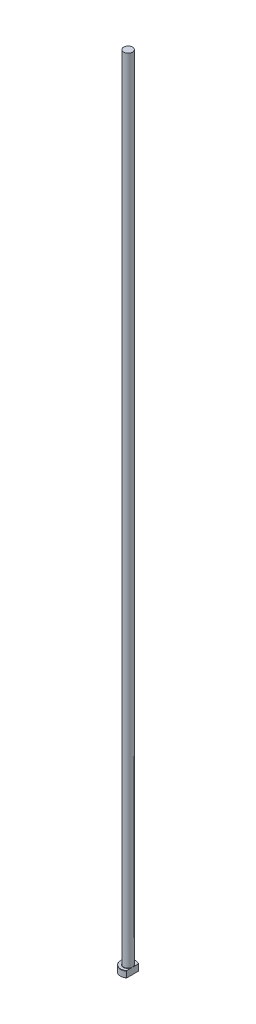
ISO-10303-21;
HEADER;
FILE_DESCRIPTION(('STEP AP214'),'2;1');
FILE_NAME('part.step','',(''),(''),'','','');
FILE_SCHEMA(('AUTOMOTIVE_DESIGN { 1 0 10303 214 1 1 1 1 }'));
ENDSEC;
DATA;
#1=APPLICATION_CONTEXT('core data for automotive mechanical design processes');
#2=APPLICATION_PROTOCOL_DEFINITION('international standard','automotive_design',2000,#1);
#3=PRODUCT_CONTEXT('',#1,'mechanical');
#4=PRODUCT('Part','Part','',(#3));
#5=PRODUCT_RELATED_PRODUCT_CATEGORY('part','',(#4));
#6=PRODUCT_DEFINITION_FORMATION('','',#4);
#7=PRODUCT_DEFINITION_CONTEXT('part definition',#1,'design');
#8=PRODUCT_DEFINITION('design','',#6,#7);
#9=PRODUCT_DEFINITION_SHAPE('','',#8);
#10=(LENGTH_UNIT() NAMED_UNIT(*) SI_UNIT(.MILLI.,.METRE.));
#11=(NAMED_UNIT(*) PLANE_ANGLE_UNIT() SI_UNIT($,.RADIAN.));
#12=(NAMED_UNIT(*) SI_UNIT($,.STERADIAN.) SOLID_ANGLE_UNIT());
#13=UNCERTAINTY_MEASURE_WITH_UNIT(LENGTH_MEASURE(1.E-05),#10,'distance_accuracy_value','');
#14=(GEOMETRIC_REPRESENTATION_CONTEXT(3) GLOBAL_UNCERTAINTY_ASSIGNED_CONTEXT((#13)) GLOBAL_UNIT_ASSIGNED_CONTEXT((#10,
#11,#12)) REPRESENTATION_CONTEXT('',''));
#15=CARTESIAN_POINT('',(0.,0.,0.));
#16=DIRECTION('',(0.,0.,1.));
#17=DIRECTION('',(1.,0.,0.));
#18=AXIS2_PLACEMENT_3D('',#15,#16,#17);
#19=CARTESIAN_POINT('',(0.,0.,0.));
#20=DIRECTION('',(0.,-1.,0.));
#21=DIRECTION('',(0.,0.,-1.));
#22=AXIS2_PLACEMENT_3D('',#19,#20,#21);
#23=PLANE('',#22);
#24=CARTESIAN_POINT('',(0.,0.,0.));
#25=DIRECTION('',(0.,-1.,0.));
#26=DIRECTION('',(0.,0.,-1.));
#27=AXIS2_PLACEMENT_3D('',#24,#25,#26);
#28=CIRCLE('',#27,5.79999999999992);
#29=CARTESIAN_POINT('',(3.49999999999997,0.,4.62493243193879));
#30=VERTEX_POINT('',#29);
#31=CARTESIAN_POINT('',(3.49999999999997,0.,-4.62493243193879));
#32=VERTEX_POINT('',#31);
#33=EDGE_CURVE('E98',#30,#32,#28,.T.);
#34=ORIENTED_EDGE('',*,*,#33,.T.);
#35=DIRECTION('',(0.,0.,1.));
#36=VECTOR('',#35,1.);
#37=CARTESIAN_POINT('',(3.49999999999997,0.,-4.87339717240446));
#38=LINE('',#37,#36);
#39=EDGE_CURVE('E83',#32,#30,#38,.T.);
#40=ORIENTED_EDGE('',*,*,#39,.T.);
#41=EDGE_LOOP('',(#34,#40));
#42=FACE_BOUND('',#41,.T.);
#43=ADVANCED_FACE('F32',(#42),#23,.T.);
#44=CARTESIAN_POINT('',(0.,259.958771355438,0.));
#45=DIRECTION('',(0.,1.,0.));
#46=DIRECTION('',(0.,0.,1.));
#47=AXIS2_PLACEMENT_3D('',#44,#45,#46);
#48=CYLINDRICAL_SURFACE('',#47,5.99999999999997);
#49=CARTESIAN_POINT('',(0.,4.80000000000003,0.));
#50=DIRECTION('',(0.,1.,0.));
#51=DIRECTION('',(0.,0.,1.));
#52=AXIS2_PLACEMENT_3D('',#49,#50,#51);
#53=CIRCLE('',#52,5.99999999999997);
#54=CARTESIAN_POINT('',(3.49999999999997,4.80000000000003,4.87339717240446));
#55=VERTEX_POINT('',#54);
#56=CARTESIAN_POINT('',(3.49999999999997,4.80000000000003,-4.87339717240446));
#57=VERTEX_POINT('',#56);
#58=EDGE_CURVE('E104',#55,#57,#53,.F.);
#59=ORIENTED_EDGE('',*,*,#58,.T.);
#60=DIRECTION('',(0.,-1.,0.));
#61=VECTOR('',#60,1.);
#62=CARTESIAN_POINT('',(3.49999999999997,630.,-4.87339717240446));
#63=LINE('',#62,#61);
#64=CARTESIAN_POINT('',(3.49999999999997,0.200000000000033,-4.87339717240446));
#65=VERTEX_POINT('',#64);
#66=EDGE_CURVE('E183',#57,#65,#63,.T.);
#67=ORIENTED_EDGE('',*,*,#66,.T.);
#68=CARTESIAN_POINT('',(0.,0.200000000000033,0.));
#69=DIRECTION('',(0.,-1.,0.));
#70=DIRECTION('',(0.,0.,-1.));
#71=AXIS2_PLACEMENT_3D('',#68,#69,#70);
#72=CIRCLE('',#71,5.99999999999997);
#73=CARTESIAN_POINT('',(3.49999999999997,0.200000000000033,4.87339717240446));
#74=VERTEX_POINT('',#73);
#75=EDGE_CURVE('E100',#65,#74,#72,.F.);
#76=ORIENTED_EDGE('',*,*,#75,.T.);
#77=DIRECTION('',(0.,-1.,0.));
#78=VECTOR('',#77,1.);
#79=CARTESIAN_POINT('',(3.49999999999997,630.,4.87339717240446));
#80=LINE('',#79,#78);
#81=EDGE_CURVE('E93',#55,#74,#80,.T.);
#82=ORIENTED_EDGE('',*,*,#81,.F.);
#83=EDGE_LOOP('',(#59,#67,#76,#82));
#84=FACE_BOUND('',#83,.T.);
#85=ADVANCED_FACE('F158',(#84),#48,.T.);
#86=CARTESIAN_POINT('',(-5.99999999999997,5.,0.));
#87=DIRECTION('',(0.,1.,0.));
#88=DIRECTION('',(0.,0.,1.));
#89=AXIS2_PLACEMENT_3D('',#86,#87,#88);
#90=PLANE('',#89);
#91=CARTESIAN_POINT('',(0.,5.,0.));
#92=DIRECTION('',(0.,1.,0.));
#93=DIRECTION('',(0.,0.,1.));
#94=AXIS2_PLACEMENT_3D('',#91,#92,#93);
#95=CIRCLE('',#94,5.79999999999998);
#96=CARTESIAN_POINT('',(3.49999999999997,5.,-4.62493243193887));
#97=VERTEX_POINT('',#96);
#98=CARTESIAN_POINT('',(3.49999999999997,5.,4.62493243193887));
#99=VERTEX_POINT('',#98);
#100=EDGE_CURVE('E178',#97,#99,#95,.T.);
#101=ORIENTED_EDGE('',*,*,#100,.T.);
#102=DIRECTION('',(0.,0.,-1.));
#103=VECTOR('',#102,1.);
#104=CARTESIAN_POINT('',(3.49999999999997,5.,0.));
#105=LINE('',#104,#103);
#106=CARTESIAN_POINT('',(3.49999999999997,4.99999999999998,1.19999999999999));
#107=VERTEX_POINT('',#106);
#108=EDGE_CURVE('E57',#99,#107,#105,.T.);
#109=ORIENTED_EDGE('',*,*,#108,.T.);
#110=CARTESIAN_POINT('',(0.,5.,0.));
#111=DIRECTION('',(0.,1.,0.));
#112=DIRECTION('',(0.,0.,1.));
#113=AXIS2_PLACEMENT_3D('',#110,#111,#112);
#114=CIRCLE('',#113,3.69999999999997);
#115=CARTESIAN_POINT('',(3.49999999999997,4.99999999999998,-1.19999999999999));
#116=VERTEX_POINT('',#115);
#117=EDGE_CURVE('E107',#107,#116,#114,.F.);
#118=ORIENTED_EDGE('',*,*,#117,.T.);
#119=EDGE_CURVE('E136',#116,#97,#105,.T.);
#120=ORIENTED_EDGE('',*,*,#119,.T.);
#121=EDGE_LOOP('',(#101,#109,#118,#120));
#122=FACE_BOUND('',#121,.T.);
#123=ADVANCED_FACE('F147',(#122),#90,.T.);
#124=CARTESIAN_POINT('',(0.,5.,0.));
#125=DIRECTION('',(0.,-1.,0.));
#126=DIRECTION('',(0.,0.,-1.));
#127=AXIS2_PLACEMENT_3D('',#124,#125,#126);
#128=CONICAL_SURFACE('',#127,5.79999999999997,0.785398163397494);
#129=ORIENTED_EDGE('',*,*,#58,.F.);
#130=CARTESIAN_POINT('',(3.49999999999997,-0.479658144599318,10.7229048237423));
#131=CARTESIAN_POINT('',(3.49999999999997,-0.304627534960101,10.5387821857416));
#132=CARTESIAN_POINT('',(3.49999999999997,-0.12982047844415,10.3544468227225));
#133=CARTESIAN_POINT('',(3.49999999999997,0.219261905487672,9.98527122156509));
#134=CARTESIAN_POINT('',(3.49999999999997,0.39353722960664,9.80043098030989));
#135=CARTESIAN_POINT('',(3.49999999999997,0.91559488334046,9.24486752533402));
#136=CARTESIAN_POINT('',(3.49999999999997,1.26244829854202,8.87327020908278));
#137=CARTESIAN_POINT('',(3.49999999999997,1.95718621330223,8.12195979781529));
#138=CARTESIAN_POINT('',(3.49999999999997,2.30502483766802,7.74220412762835));
#139=CARTESIAN_POINT('',(3.49999999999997,2.82267860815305,7.16898192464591));
#140=CARTESIAN_POINT('',(3.49999999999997,2.99451670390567,6.97734293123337));
#141=CARTESIAN_POINT('',(3.49999999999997,3.33649221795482,6.59255347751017));
#142=CARTESIAN_POINT('',(3.49999999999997,3.50662964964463,6.39940302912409));
#143=CARTESIAN_POINT('',(3.49999999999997,3.80984794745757,6.05127590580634));
#144=CARTESIAN_POINT('',(3.49999999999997,3.9433293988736,5.89664839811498));
#145=CARTESIAN_POINT('',(3.49999999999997,4.20861192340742,5.58595941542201));
#146=CARTESIAN_POINT('',(3.49999999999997,4.34041301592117,5.42989795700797));
#147=CARTESIAN_POINT('',(3.49999999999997,4.60204886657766,5.11587234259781));
#148=CARTESIAN_POINT('',(3.49999999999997,4.73188156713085,4.9579064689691));
#149=CARTESIAN_POINT('',(3.49999999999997,4.98887681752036,4.63982145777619));
#150=CARTESIAN_POINT('',(3.49999999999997,5.11603946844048,4.47970240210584));
#151=CARTESIAN_POINT('',(3.49999999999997,5.36664013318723,4.15712646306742));
#152=CARTESIAN_POINT('',(3.49999999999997,5.49008567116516,3.99467544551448));
#153=CARTESIAN_POINT('',(3.49999999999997,5.73245687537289,3.6663703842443));
#154=CARTESIAN_POINT('',(3.49999999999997,5.85138169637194,3.50051571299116));
#155=CARTESIAN_POINT('',(3.49999999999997,6.08288587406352,3.16479623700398));
#156=CARTESIAN_POINT('',(3.49999999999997,6.19547497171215,2.99493819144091));
#157=CARTESIAN_POINT('',(3.49999999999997,6.41208556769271,2.6498795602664));
#158=CARTESIAN_POINT('',(3.49999999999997,6.51611116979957,2.47468158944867));
#159=CARTESIAN_POINT('',(3.49999999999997,6.68667355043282,2.16371702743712));
#160=CARTESIAN_POINT('',(3.49999999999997,6.75595020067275,2.02946380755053));
#161=CARTESIAN_POINT('',(3.49999999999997,6.88572771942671,1.75668071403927));
#162=CARTESIAN_POINT('',(3.49999999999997,6.9462264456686,1.61814980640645));
#163=CARTESIAN_POINT('',(3.49999999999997,7.05535730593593,1.33751093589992));
#164=CARTESIAN_POINT('',(3.49999999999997,7.10406788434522,1.1954339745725));
#165=CARTESIAN_POINT('',(3.49999999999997,7.18698872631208,0.907101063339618));
#166=CARTESIAN_POINT('',(3.49999999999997,7.22121012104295,0.760848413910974));
#167=CARTESIAN_POINT('',(3.49999999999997,7.26487302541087,0.507831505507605));
#168=CARTESIAN_POINT('',(3.49999999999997,7.27861043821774,0.401805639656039));
#169=CARTESIAN_POINT('',(3.49999999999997,7.29650595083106,0.188947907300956));
#170=CARTESIAN_POINT('',(3.49999999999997,7.30066582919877,0.0821161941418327));
#171=CARTESIAN_POINT('',(3.49999999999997,7.29916002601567,-0.131492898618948));
#172=CARTESIAN_POINT('',(3.49999999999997,7.29349282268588,-0.238270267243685));
#173=CARTESIAN_POINT('',(3.49999999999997,7.27266406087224,-0.450895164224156));
#174=CARTESIAN_POINT('',(3.49999999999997,7.25750065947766,-0.556742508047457));
#175=CARTESIAN_POINT('',(3.49999999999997,7.21256554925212,-0.79858965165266));
#176=CARTESIAN_POINT('',(3.49999999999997,7.17976248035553,-0.934025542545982));
#177=CARTESIAN_POINT('',(3.49999999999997,7.10180151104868,-1.20127435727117));
#178=CARTESIAN_POINT('',(3.49999999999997,7.05663717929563,-1.33308535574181));
#179=CARTESIAN_POINT('',(3.49999999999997,6.95617548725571,-1.59358719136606));
#180=CARTESIAN_POINT('',(3.49999999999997,6.90082290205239,-1.72225647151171));
#181=CARTESIAN_POINT('',(3.49999999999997,6.81196782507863,-1.91246868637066));
#182=CARTESIAN_POINT('',(3.49999999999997,6.78138093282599,-1.97540288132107));
#183=CARTESIAN_POINT('',(3.49999999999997,6.71848328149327,-2.10040375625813));
#184=CARTESIAN_POINT('',(3.49999999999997,6.68617255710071,-2.16247045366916));
#185=CARTESIAN_POINT('',(3.49999999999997,6.59348343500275,-2.33529342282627));
#186=CARTESIAN_POINT('',(3.49999999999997,6.53139715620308,-2.44513435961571));
#187=CARTESIAN_POINT('',(3.49999999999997,6.40327495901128,-2.66249790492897));
#188=CARTESIAN_POINT('',(3.49999999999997,6.33723828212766,-2.77002006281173));
#189=CARTESIAN_POINT('',(3.49999999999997,6.20193961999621,-2.98310926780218));
#190=CARTESIAN_POINT('',(3.49999999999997,6.13267551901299,-3.08867496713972));
#191=CARTESIAN_POINT('',(3.49999999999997,5.99154722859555,-3.29805772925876));
#192=CARTESIAN_POINT('',(3.49999999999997,5.91968285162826,-3.40187466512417));
#193=CARTESIAN_POINT('',(3.49999999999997,5.70053198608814,-3.71160333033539));
#194=CARTESIAN_POINT('',(3.49999999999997,5.55004115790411,-3.91524708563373));
#195=CARTESIAN_POINT('',(3.49999999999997,5.24323373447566,-4.31793623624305));
#196=CARTESIAN_POINT('',(3.49999999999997,5.08691924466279,-4.5169832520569));
#197=CARTESIAN_POINT('',(3.49999999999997,4.76917008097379,-4.91272714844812));
#198=CARTESIAN_POINT('',(3.49999999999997,4.60771212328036,-5.10940527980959));
#199=CARTESIAN_POINT('',(3.49999999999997,4.28159454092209,-5.50010578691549));
#200=CARTESIAN_POINT('',(3.49999999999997,4.11693466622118,-5.69412795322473));
#201=CARTESIAN_POINT('',(3.49999999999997,3.7854437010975,-6.07977702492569));
#202=CARTESIAN_POINT('',(3.49999999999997,3.61861641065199,-6.27140720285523));
#203=CARTESIAN_POINT('',(3.49999999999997,3.28306967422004,-6.65300504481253));
#204=CARTESIAN_POINT('',(3.49999999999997,3.11435020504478,-6.84297268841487));
#205=CARTESIAN_POINT('',(3.49999999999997,2.66324311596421,-7.3468737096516));
#206=CARTESIAN_POINT('',(3.49999999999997,2.37954008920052,-7.65962881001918));
#207=CARTESIAN_POINT('',(3.49999999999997,1.80910784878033,-8.28261634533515));
#208=CARTESIAN_POINT('',(3.49999999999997,1.52237733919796,-8.59284759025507));
#209=CARTESIAN_POINT('',(3.49999999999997,0.950562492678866,-9.20727688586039));
#210=CARTESIAN_POINT('',(3.49999999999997,0.665505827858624,-9.51150072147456));
#211=CARTESIAN_POINT('',(3.49999999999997,0.0939335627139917,-10.1182972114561));
#212=CARTESIAN_POINT('',(3.49999999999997,-0.192581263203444,-10.4208705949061));
#213=CARTESIAN_POINT('',(3.49999999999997,-0.479658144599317,-10.7229048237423));
#214=B_SPLINE_CURVE_WITH_KNOTS('',3,(#130,#131,#132,#133,#134,#135,#136,#137,#138,#139,#140,
#141,#142,#143,#144,#145,#146,#147,#148,#149,#150,#151,#152,#153,#154,#155,#156,#157,#158,#159,
#160,#161,#162,#163,#164,#165,#166,#167,#168,#169,#170,#171,#172,#173,#174,#175,#176,#177,#178,
#179,#180,#181,#182,#183,#184,#185,#186,#187,#188,#189,#190,#191,#192,#193,#194,#195,#196,#197,
#198,#199,#200,#201,#202,#203,#204,#205,#206,#207,#208,#209,#210,#211,#212,#213),.UNSPECIFIED.,
.F.,.F.,(4,2,2,2,2,2,2,2,2,2,2,2,2,2,2,2,2,2,2,2,2,2,2,2,2,2,2,2,2,2,2,2,2,2,2,2,2,2,2,2,2,4),
(0.,0.762123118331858,1.52425095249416,3.04920520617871,4.59410962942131,5.36629689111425,
6.13847806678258,6.75128402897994,7.36408291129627,7.97748343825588,8.59086070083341,
9.20289910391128,9.81505138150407,10.4262352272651,11.0371244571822,11.4901076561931,
11.94320122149,12.393191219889,12.842834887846,13.1631796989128,13.4834650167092,
13.8037999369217,14.1241970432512,14.5415079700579,14.9590364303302,15.3788985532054,
15.5887982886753,15.7986938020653,16.1771020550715,16.5555831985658,16.9343160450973,
17.3130762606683,18.0725457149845,18.8317432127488,19.5950831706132,20.3584829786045,
21.1206884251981,21.88290322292,23.1496528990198,24.4169687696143,25.6676760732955,
26.9177769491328),.UNSPECIFIED.);
#215=EDGE_CURVE('E135',#55,#99,#214,.T.);
#216=ORIENTED_EDGE('',*,*,#215,.T.);
#217=ORIENTED_EDGE('',*,*,#100,.F.);
#218=EDGE_CURVE('E127',#97,#57,#214,.T.);
#219=ORIENTED_EDGE('',*,*,#218,.T.);
#220=EDGE_LOOP('',(#129,#216,#217,#219));
#221=FACE_BOUND('',#220,.T.);
#222=ADVANCED_FACE('F143',(#221),#128,.T.);
#223=CARTESIAN_POINT('',(0.,0.200000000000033,0.));
#224=DIRECTION('',(0.,1.,0.));
#225=DIRECTION('',(0.,0.,1.));
#226=AXIS2_PLACEMENT_3D('',#223,#224,#225);
#227=CONICAL_SURFACE('',#226,5.99999999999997,0.785398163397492);
#228=ORIENTED_EDGE('',*,*,#75,.F.);
#229=CARTESIAN_POINT('',(3.49999999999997,5.4796581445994,-10.7229048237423));
#230=CARTESIAN_POINT('',(3.49999999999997,5.30462753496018,-10.5387821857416));
#231=CARTESIAN_POINT('',(3.49999999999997,5.12982047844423,-10.3544468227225));
#232=CARTESIAN_POINT('',(3.49999999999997,4.78073809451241,-9.98527122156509));
#233=CARTESIAN_POINT('',(3.49999999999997,4.60646277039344,-9.80043098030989));
#234=CARTESIAN_POINT('',(3.49999999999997,4.08440511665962,-9.24486752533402));
#235=CARTESIAN_POINT('',(3.49999999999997,3.73755170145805,-8.87327020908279));
#236=CARTESIAN_POINT('',(3.49999999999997,3.04281378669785,-8.12195979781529));
#237=CARTESIAN_POINT('',(3.49999999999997,2.69497516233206,-7.74220412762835));
#238=CARTESIAN_POINT('',(3.49999999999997,2.17732139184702,-7.16898192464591));
#239=CARTESIAN_POINT('',(3.49999999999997,2.0054832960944,-6.97734293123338));
#240=CARTESIAN_POINT('',(3.49999999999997,1.66350778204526,-6.59255347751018));
#241=CARTESIAN_POINT('',(3.49999999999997,1.49337035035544,-6.3994030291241));
#242=CARTESIAN_POINT('',(3.49999999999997,1.1901520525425,-6.05127590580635));
#243=CARTESIAN_POINT('',(3.49999999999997,1.05667060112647,-5.89664839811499));
#244=CARTESIAN_POINT('',(3.49999999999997,0.79138807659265,-5.58595941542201));
#245=CARTESIAN_POINT('',(3.49999999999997,0.659586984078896,-5.42989795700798));
#246=CARTESIAN_POINT('',(3.49999999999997,0.3979511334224,-5.11587234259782));
#247=CARTESIAN_POINT('',(3.49999999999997,0.268118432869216,-4.95790646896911));
#248=CARTESIAN_POINT('',(3.49999999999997,0.0111231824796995,-4.63982145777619));
#249=CARTESIAN_POINT('',(3.49999999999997,-0.116039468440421,-4.47970240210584));
#250=CARTESIAN_POINT('',(3.49999999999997,-0.366640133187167,-4.15712646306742));
#251=CARTESIAN_POINT('',(3.49999999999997,-0.490085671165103,-3.99467544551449));
#252=CARTESIAN_POINT('',(3.49999999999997,-0.732456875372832,-3.6663703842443));
#253=CARTESIAN_POINT('',(3.49999999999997,-0.851381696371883,-3.50051571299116));
#254=CARTESIAN_POINT('',(3.49999999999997,-1.08288587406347,-3.16479623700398));
#255=CARTESIAN_POINT('',(3.49999999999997,-1.19547497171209,-2.99493819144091));
#256=CARTESIAN_POINT('',(3.49999999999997,-1.41208556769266,-2.6498795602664));
#257=CARTESIAN_POINT('',(3.49999999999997,-1.51611116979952,-2.47468158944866));
#258=CARTESIAN_POINT('',(3.49999999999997,-1.68667355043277,-2.16371702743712));
#259=CARTESIAN_POINT('',(3.49999999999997,-1.7559502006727,-2.02946380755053));
#260=CARTESIAN_POINT('',(3.49999999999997,-1.88572771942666,-1.75668071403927));
#261=CARTESIAN_POINT('',(3.49999999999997,-1.94622644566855,-1.61814980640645));
#262=CARTESIAN_POINT('',(3.49999999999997,-2.05535730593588,-1.33751093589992));
#263=CARTESIAN_POINT('',(3.49999999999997,-2.10406788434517,-1.1954339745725));
#264=CARTESIAN_POINT('',(3.49999999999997,-2.18698872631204,-0.907101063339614));
#265=CARTESIAN_POINT('',(3.49999999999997,-2.2212101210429,-0.760848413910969));
#266=CARTESIAN_POINT('',(3.49999999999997,-2.26487302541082,-0.5078315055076));
#267=CARTESIAN_POINT('',(3.49999999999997,-2.27861043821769,-0.401805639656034));
#268=CARTESIAN_POINT('',(3.49999999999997,-2.29650595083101,-0.188947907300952));
#269=CARTESIAN_POINT('',(3.49999999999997,-2.30066582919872,-0.0821161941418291));
#270=CARTESIAN_POINT('',(3.49999999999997,-2.29916002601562,0.131492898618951));
#271=CARTESIAN_POINT('',(3.49999999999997,-2.29349282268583,0.238270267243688));
#272=CARTESIAN_POINT('',(3.49999999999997,-2.27266406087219,0.450895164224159));
#273=CARTESIAN_POINT('',(3.49999999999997,-2.25750065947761,0.556742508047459));
#274=CARTESIAN_POINT('',(3.49999999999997,-2.21256554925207,0.798589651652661));
#275=CARTESIAN_POINT('',(3.49999999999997,-2.17976248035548,0.934025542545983));
#276=CARTESIAN_POINT('',(3.49999999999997,-2.10180151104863,1.20127435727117));
#277=CARTESIAN_POINT('',(3.49999999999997,-2.05663717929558,1.33308535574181));
#278=CARTESIAN_POINT('',(3.49999999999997,-1.95617548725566,1.59358719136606));
#279=CARTESIAN_POINT('',(3.49999999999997,-1.90082290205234,1.72225647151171));
#280=CARTESIAN_POINT('',(3.49999999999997,-1.81196782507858,1.91246868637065));
#281=CARTESIAN_POINT('',(3.49999999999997,-1.78138093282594,1.97540288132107));
#282=CARTESIAN_POINT('',(3.49999999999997,-1.71848328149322,2.10040375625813));
#283=CARTESIAN_POINT('',(3.49999999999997,-1.68617255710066,2.16247045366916));
#284=CARTESIAN_POINT('',(3.49999999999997,-1.5934834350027,2.33529342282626));
#285=CARTESIAN_POINT('',(3.49999999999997,-1.53139715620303,2.4451343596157));
#286=CARTESIAN_POINT('',(3.49999999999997,-1.40327495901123,2.66249790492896));
#287=CARTESIAN_POINT('',(3.49999999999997,-1.33723828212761,2.77002006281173));
#288=CARTESIAN_POINT('',(3.49999999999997,-1.20193961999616,2.98310926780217));
#289=CARTESIAN_POINT('',(3.49999999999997,-1.13267551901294,3.08867496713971));
#290=CARTESIAN_POINT('',(3.49999999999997,-0.991547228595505,3.29805772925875));
#291=CARTESIAN_POINT('',(3.49999999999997,-0.919682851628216,3.40187466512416));
#292=CARTESIAN_POINT('',(3.49999999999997,-0.700531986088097,3.71160333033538));
#293=CARTESIAN_POINT('',(3.49999999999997,-0.550041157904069,3.91524708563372));
#294=CARTESIAN_POINT('',(3.49999999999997,-0.243233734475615,4.31793623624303));
#295=CARTESIAN_POINT('',(3.49999999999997,-0.0869192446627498,4.51698325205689));
#296=CARTESIAN_POINT('',(3.49999999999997,0.230829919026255,4.9127271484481));
#297=CARTESIAN_POINT('',(3.49999999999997,0.392287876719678,5.10940527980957));
#298=CARTESIAN_POINT('',(3.49999999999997,0.71840545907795,5.50010578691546));
#299=CARTESIAN_POINT('',(3.49999999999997,0.883065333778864,5.69412795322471));
#300=CARTESIAN_POINT('',(3.49999999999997,1.21455629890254,6.07977702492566));
#301=CARTESIAN_POINT('',(3.49999999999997,1.38138358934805,6.2714072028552));
#302=CARTESIAN_POINT('',(3.49999999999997,1.71693032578,6.65300504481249));
#303=CARTESIAN_POINT('',(3.49999999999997,1.88564979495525,6.84297268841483));
#304=CARTESIAN_POINT('',(3.49999999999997,2.33675688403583,7.34687370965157));
#305=CARTESIAN_POINT('',(3.49999999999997,2.62045991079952,7.65962881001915));
#306=CARTESIAN_POINT('',(3.49999999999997,3.19089215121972,8.28261634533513));
#307=CARTESIAN_POINT('',(3.49999999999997,3.47762266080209,8.59284759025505));
#308=CARTESIAN_POINT('',(3.49999999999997,4.0494375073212,9.20727688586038));
#309=CARTESIAN_POINT('',(3.49999999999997,4.33449417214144,9.51150072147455));
#310=CARTESIAN_POINT('',(3.49999999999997,4.90606643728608,10.1182972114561));
#311=CARTESIAN_POINT('',(3.49999999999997,5.19258126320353,10.4208705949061));
#312=CARTESIAN_POINT('',(3.49999999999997,5.4796581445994,10.7229048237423));
#313=B_SPLINE_CURVE_WITH_KNOTS('',3,(#229,#230,#231,#232,#233,#234,#235,#236,#237,#238,#239,
#240,#241,#242,#243,#244,#245,#246,#247,#248,#249,#250,#251,#252,#253,#254,#255,#256,#257,#258,
#259,#260,#261,#262,#263,#264,#265,#266,#267,#268,#269,#270,#271,#272,#273,#274,#275,#276,#277,
#278,#279,#280,#281,#282,#283,#284,#285,#286,#287,#288,#289,#290,#291,#292,#293,#294,#295,#296,
#297,#298,#299,#300,#301,#302,#303,#304,#305,#306,#307,#308,#309,#310,#311,#312),.UNSPECIFIED.,
.F.,.F.,(4,2,2,2,2,2,2,2,2,2,2,2,2,2,2,2,2,2,2,2,2,2,2,2,2,2,2,2,2,2,2,2,2,2,2,2,2,2,2,2,2,4),
(0.,0.762123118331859,1.52425095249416,3.04920520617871,4.59410962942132,5.36629689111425,
6.13847806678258,6.75128402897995,7.36408291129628,7.9774834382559,8.59086070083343,
9.20289910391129,9.81505138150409,10.4262352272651,11.0371244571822,11.4901076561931,
11.94320122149,12.393191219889,12.842834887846,13.1631796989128,13.4834650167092,
13.8037999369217,14.1241970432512,14.541507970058,14.9590364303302,15.3788985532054,
15.5887982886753,15.7986938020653,16.1771020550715,16.5555831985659,16.9343160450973,
17.3130762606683,18.0725457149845,18.8317432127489,19.5950831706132,20.3584829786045,
21.1206884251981,21.88290322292,23.1496528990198,24.4169687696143,25.6676760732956,
26.9177769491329),.UNSPECIFIED.);
#314=EDGE_CURVE('E86',#65,#32,#313,.T.);
#315=ORIENTED_EDGE('',*,*,#314,.T.);
#316=ORIENTED_EDGE('',*,*,#33,.F.);
#317=EDGE_CURVE('E89',#30,#74,#313,.T.);
#318=ORIENTED_EDGE('',*,*,#317,.T.);
#319=EDGE_LOOP('',(#228,#315,#316,#318));
#320=FACE_BOUND('',#319,.T.);
#321=ADVANCED_FACE('F97',(#320),#227,.T.);
#322=CARTESIAN_POINT('',(0.,5.19999999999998,0.));
#323=DIRECTION('',(0.,1.,0.));
#324=DIRECTION('',(0.,0.,1.));
#325=AXIS2_PLACEMENT_3D('',#322,#323,#324);
#326=TOROIDAL_SURFACE('',#325,3.69999999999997,0.2);
#327=CARTESIAN_POINT('',(3.49999999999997,5.19999999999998,0.));
#328=CARTESIAN_POINT('',(3.49999999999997,5.20000050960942,9.98094828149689E-11));
#329=CARTESIAN_POINT('',(3.49999999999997,5.20000101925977,-2.13486746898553E-07));
#330=CARTESIAN_POINT('',(3.49999999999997,5.20000196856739,-7.957591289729E-07));
#331=CARTESIAN_POINT('',(3.49999999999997,5.20000239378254,-1.17925839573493E-06));
#332=CARTESIAN_POINT('',(3.49999999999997,5.20000328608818,-2.10014972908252E-06));
#333=CARTESIAN_POINT('',(3.49999999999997,5.20000373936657,-2.65249908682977E-06));
#334=CARTESIAN_POINT('',(3.49999999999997,5.20000454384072,-3.79112889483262E-06));
#335=CARTESIAN_POINT('',(3.49999999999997,5.20000489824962,-4.37533521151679E-06));
#336=CARTESIAN_POINT('',(3.49999999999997,5.20000623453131,-6.66270059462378E-06));
#337=CARTESIAN_POINT('',(3.49999999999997,5.20000714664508,-8.40961025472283E-06));
#338=CARTESIAN_POINT('',(3.49999999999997,5.20000862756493,-1.18496824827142E-05));
#339=CARTESIAN_POINT('',(3.49999999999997,5.20000922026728,-1.35329548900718E-05));
#340=CARTESIAN_POINT('',(3.49999999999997,5.20001174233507,-2.07268950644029E-05));
#341=CARTESIAN_POINT('',(3.49999999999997,5.20001365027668,-2.62477536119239E-05));
#342=CARTESIAN_POINT('',(3.49999999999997,5.20001642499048,-3.66274572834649E-05));
#343=CARTESIAN_POINT('',(3.49999999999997,5.20001740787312,-4.14549355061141E-05));
#344=CARTESIAN_POINT('',(3.49999999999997,5.20002462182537,-7.75352102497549E-05));
#345=CARTESIAN_POINT('',(3.49999999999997,5.20003014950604,-0.000108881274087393));
#346=CARTESIAN_POINT('',(3.49999999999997,5.20005434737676,-0.000233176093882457));
#347=CARTESIAN_POINT('',(3.49999999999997,5.20007737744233,-0.000325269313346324));
#348=CARTESIAN_POINT('',(3.49999999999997,5.20016742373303,-0.000691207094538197));
#349=CARTESIAN_POINT('',(3.49999999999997,5.20023166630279,-0.000965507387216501));
#350=CARTESIAN_POINT('',(3.49999999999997,5.20048971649,-0.0020594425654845));
#351=CARTESIAN_POINT('',(3.49999999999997,5.20068705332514,-0.00287847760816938));
#352=CARTESIAN_POINT('',(3.49999999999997,5.20150941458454,-0.00630050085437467));
#353=CARTESIAN_POINT('',(3.49999999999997,5.20212997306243,-0.00890424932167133));
#354=CARTESIAN_POINT('',(3.49999999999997,5.20703918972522,-0.0294912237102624));
#355=CARTESIAN_POINT('',(3.49999999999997,5.21134300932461,-0.0474719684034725));
#356=CARTESIAN_POINT('',(3.49999999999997,5.21975360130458,-0.0827191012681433));
#357=CARTESIAN_POINT('',(3.49999999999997,5.22386136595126,-0.0999852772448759));
#358=CARTESIAN_POINT('',(3.49999999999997,5.2372401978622,-0.156405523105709));
#359=CARTESIAN_POINT('',(3.49999999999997,5.24645854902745,-0.195572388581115));
#360=CARTESIAN_POINT('',(3.49999999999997,5.26203234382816,-0.262828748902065));
#361=CARTESIAN_POINT('',(3.49999999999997,5.26845671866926,-0.290902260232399));
#362=CARTESIAN_POINT('',(3.49999999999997,5.28094671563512,-0.346379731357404));
#363=CARTESIAN_POINT('',(3.49999999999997,5.28701730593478,-0.373782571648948));
#364=CARTESIAN_POINT('',(3.49999999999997,5.30077691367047,-0.437211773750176));
#365=CARTESIAN_POINT('',(3.49999999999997,5.3083789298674,-0.473257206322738));
#366=CARTESIAN_POINT('',(3.49999999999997,5.32309409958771,-0.545736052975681));
#367=CARTESIAN_POINT('',(3.49999999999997,5.33020304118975,-0.582170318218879));
#368=CARTESIAN_POINT('',(3.49999999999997,5.35161649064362,-0.697757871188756));
#369=CARTESIAN_POINT('',(3.49999999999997,5.36463967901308,-0.777158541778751));
#370=CARTESIAN_POINT('',(3.49999999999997,5.3843837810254,-0.92756184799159));
#371=CARTESIAN_POINT('',(3.49999999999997,5.39165512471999,-0.998486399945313));
#372=CARTESIAN_POINT('',(3.49999999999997,5.3979989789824,-1.10437287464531));
#373=CARTESIAN_POINT('',(3.49999999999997,5.39936233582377,-1.13919451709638));
#374=CARTESIAN_POINT('',(3.49999999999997,5.40028946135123,-1.20885098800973));
#375=CARTESIAN_POINT('',(3.49999999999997,5.39985418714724,-1.24368579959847));
#376=CARTESIAN_POINT('',(3.49999999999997,5.39686573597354,-1.30963279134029));
#377=CARTESIAN_POINT('',(3.49999999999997,5.39453835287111,-1.34075403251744));
#378=CARTESIAN_POINT('',(3.49999999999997,5.38750048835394,-1.40298456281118));
#379=CARTESIAN_POINT('',(3.49999999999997,5.38277118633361,-1.43409178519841));
#380=CARTESIAN_POINT('',(3.49999999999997,5.37000596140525,-1.49609278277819));
#381=CARTESIAN_POINT('',(3.49999999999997,5.36193044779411,-1.52697933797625));
#382=CARTESIAN_POINT('',(3.49999999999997,5.34614337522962,-1.57192957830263));
#383=CARTESIAN_POINT('',(3.49999999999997,5.3402919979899,-1.5866404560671));
#384=CARTESIAN_POINT('',(3.49999999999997,5.32701491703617,-1.6153215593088));
#385=CARTESIAN_POINT('',(3.49999999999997,5.31959341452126,-1.6292936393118));
#386=CARTESIAN_POINT('',(3.49999999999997,5.30547056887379,-1.65150372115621));
#387=CARTESIAN_POINT('',(3.49999999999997,5.29934759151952,-1.6601058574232));
#388=CARTESIAN_POINT('',(3.49999999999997,5.28595656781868,-1.67637400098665));
#389=CARTESIAN_POINT('',(3.49999999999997,5.27869146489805,-1.68404232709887));
#390=CARTESIAN_POINT('',(3.49999999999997,5.26587375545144,-1.69518467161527));
#391=CARTESIAN_POINT('',(3.49999999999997,5.26073958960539,-1.69913647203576));
#392=CARTESIAN_POINT('',(3.49999999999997,5.24994100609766,-1.70624293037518));
#393=CARTESIAN_POINT('',(3.49999999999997,5.24427723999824,-1.70939855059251));
#394=CARTESIAN_POINT('',(3.49999999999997,5.23351378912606,-1.71418736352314));
#395=CARTESIAN_POINT('',(3.49999999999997,5.22849079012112,-1.71599090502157));
#396=CARTESIAN_POINT('',(3.49999999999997,5.21821361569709,-1.71873268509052));
#397=CARTESIAN_POINT('',(3.49999999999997,5.21295968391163,-1.71967181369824));
#398=CARTESIAN_POINT('',(3.49999999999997,5.20234462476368,-1.72059432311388));
#399=CARTESIAN_POINT('',(3.49999999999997,5.19698314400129,-1.72057373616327));
#400=CARTESIAN_POINT('',(3.49999999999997,5.18635093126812,-1.71956893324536));
#401=CARTESIAN_POINT('',(3.49999999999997,5.18108024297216,-1.71858426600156));
#402=CARTESIAN_POINT('',(3.49999999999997,5.17106869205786,-1.71582968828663));
#403=CARTESIAN_POINT('',(3.49999999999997,5.16631466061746,-1.71410641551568));
#404=CARTESIAN_POINT('',(3.49999999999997,5.15709718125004,-1.71001459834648));
#405=CARTESIAN_POINT('',(3.49999999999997,5.15263381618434,-1.70764587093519));
#406=CARTESIAN_POINT('',(3.49999999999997,5.14110717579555,-1.70060771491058));
#407=CARTESIAN_POINT('',(3.49999999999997,5.13433222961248,-1.69546710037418));
#408=CARTESIAN_POINT('',(3.49999999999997,5.12164557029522,-1.68420869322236));
#409=CARTESIAN_POINT('',(3.49999999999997,5.11573697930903,-1.67808752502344));
#410=CARTESIAN_POINT('',(3.49999999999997,5.10028952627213,-1.66008531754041));
#411=CARTESIAN_POINT('',(3.49999999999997,5.09159238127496,-1.64748936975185));
#412=CARTESIAN_POINT('',(3.49999999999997,5.07604019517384,-1.62125022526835));
#413=CARTESIAN_POINT('',(3.49999999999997,5.06918749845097,-1.60760572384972));
#414=CARTESIAN_POINT('',(3.49999999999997,5.05635908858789,-1.57851190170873));
#415=CARTESIAN_POINT('',(3.49999999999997,5.05050870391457,-1.56300807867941));
#416=CARTESIAN_POINT('',(3.49999999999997,5.04009412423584,-1.53156759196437));
#417=CARTESIAN_POINT('',(3.49999999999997,5.03553147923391,-1.51563043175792));
#418=CARTESIAN_POINT('',(3.49999999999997,5.02331191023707,-1.46712048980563));
#419=CARTESIAN_POINT('',(3.49999999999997,5.01724153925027,-1.4341495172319));
#420=CARTESIAN_POINT('',(3.49999999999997,5.00883071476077,-1.37348993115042));
#421=CARTESIAN_POINT('',(3.49999999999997,5.00603148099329,-1.34585663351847));
#422=CARTESIAN_POINT('',(3.49999999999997,5.00204762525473,-1.29046925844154));
#423=CARTESIAN_POINT('',(3.49999999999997,5.00086336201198,-1.26271515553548));
#424=CARTESIAN_POINT('',(3.49999999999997,4.99925913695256,-1.17922229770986));
#425=CARTESIAN_POINT('',(3.49999999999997,5.00080993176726,-1.1234488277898));
#426=CARTESIAN_POINT('',(3.49999999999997,5.00738569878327,-1.01528124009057));
#427=CARTESIAN_POINT('',(3.49999999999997,5.01221131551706,-0.962872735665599));
#428=CARTESIAN_POINT('',(3.49999999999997,5.02425367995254,-0.858750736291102));
#429=CARTESIAN_POINT('',(3.49999999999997,5.03145152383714,-0.807035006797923));
#430=CARTESIAN_POINT('',(3.49999999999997,5.04786442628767,-0.702500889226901));
#431=CARTESIAN_POINT('',(3.49999999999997,5.05712869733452,-0.649690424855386));
#432=CARTESIAN_POINT('',(3.49999999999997,5.07730630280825,-0.542969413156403));
#433=CARTESIAN_POINT('',(3.49999999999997,5.08825618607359,-0.489065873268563));
#434=CARTESIAN_POINT('',(3.49999999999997,5.10770336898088,-0.397738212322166));
#435=CARTESIAN_POINT('',(3.49999999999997,5.11594150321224,-0.360258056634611));
#436=CARTESIAN_POINT('',(3.49999999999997,5.1326812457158,-0.285797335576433));
#437=CARTESIAN_POINT('',(3.49999999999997,5.14117887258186,-0.248815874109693));
#438=CARTESIAN_POINT('',(3.49999999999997,5.15740628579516,-0.179140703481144));
#439=CARTESIAN_POINT('',(3.49999999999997,5.16511243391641,-0.146441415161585));
#440=CARTESIAN_POINT('',(3.49999999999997,5.18096853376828,-0.0796648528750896));
#441=CARTESIAN_POINT('',(3.49999999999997,5.18912333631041,-0.045588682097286));
#442=CARTESIAN_POINT('',(3.49999999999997,5.19787118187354,-0.00889903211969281));
#443=CARTESIAN_POINT('',(3.49999999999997,5.19849305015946,-0.00629009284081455));
#444=CARTESIAN_POINT('',(3.49999999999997,5.19931571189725,-0.00286690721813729));
#445=CARTESIAN_POINT('',(3.49999999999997,5.19951207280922,-0.0020519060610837));
#446=CARTESIAN_POINT('',(3.49999999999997,5.19976893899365,-0.0009629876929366));
#447=CARTESIAN_POINT('',(3.49999999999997,5.19983295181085,-0.00068966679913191));
#448=CARTESIAN_POINT('',(3.49999999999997,5.19992272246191,-0.000324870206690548));
#449=CARTESIAN_POINT('',(3.49999999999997,5.19994571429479,-0.000232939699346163));
#450=CARTESIAN_POINT('',(3.49999999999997,5.19996987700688,-0.000108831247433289));
#451=CARTESIAN_POINT('',(3.49999999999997,5.19997540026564,-7.75074375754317E-05));
#452=CARTESIAN_POINT('',(3.49999999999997,5.19998260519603,-4.1449950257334E-05));
#453=CARTESIAN_POINT('',(3.49999999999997,5.19998358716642,-3.66236562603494E-05));
#454=CARTESIAN_POINT('',(3.49999999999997,5.19998635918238,-2.62464271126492E-05));
#455=CARTESIAN_POINT('',(3.49999999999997,5.19998826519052,-2.07267962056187E-05));
#456=CARTESIAN_POINT('',(3.49999999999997,5.19999078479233,-1.353414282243E-05));
#457=CARTESIAN_POINT('',(3.49999999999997,5.19999137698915,-1.18509583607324E-05));
#458=CARTESIAN_POINT('',(3.49999999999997,5.19999285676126,-8.4109834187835E-06));
#459=CARTESIAN_POINT('',(3.49999999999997,5.19999376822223,-6.66407126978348E-06));
#460=CARTESIAN_POINT('',(3.49999999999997,5.19999510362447,-4.37661194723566E-06));
#461=CARTESIAN_POINT('',(3.49999999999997,5.19999545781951,-3.79235333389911E-06));
#462=CARTESIAN_POINT('',(3.49999999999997,5.19999626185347,-2.65358032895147E-06));
#463=CARTESIAN_POINT('',(3.49999999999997,5.19999671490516,-2.10113839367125E-06));
#464=CARTESIAN_POINT('',(3.49999999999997,5.1999976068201,-1.18003190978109E-06));
#465=CARTESIAN_POINT('',(3.49999999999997,5.19999803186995,-7.96418762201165E-07));
#466=CARTESIAN_POINT('',(3.49999999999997,5.19999898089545,-2.13855187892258E-07));
#467=CARTESIAN_POINT('',(3.49999999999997,5.19999949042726,-9.98022935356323E-11));
#468=CARTESIAN_POINT('',(3.49999999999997,5.19999999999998,0.));
#469=B_SPLINE_CURVE_WITH_KNOTS('',3,(#327,#328,#329,#330,#331,#332,#333,#334,#335,#336,#337,
#338,#339,#340,#341,#342,#343,#344,#345,#346,#347,#348,#349,#350,#351,#352,#353,#354,#355,#356,
#357,#358,#359,#360,#361,#362,#363,#364,#365,#366,#367,#368,#369,#370,#371,#372,#373,#374,#375,
#376,#377,#378,#379,#380,#381,#382,#383,#384,#385,#386,#387,#388,#389,#390,#391,#392,#393,#394,
#395,#396,#397,#398,#399,#400,#401,#402,#403,#404,#405,#406,#407,#408,#409,#410,#411,#412,#413,
#414,#415,#416,#417,#418,#419,#420,#421,#422,#423,#424,#425,#426,#427,#428,#429,#430,#431,#432,
#433,#434,#435,#436,#437,#438,#439,#440,#441,#442,#443,#444,#445,#446,#447,#448,#449,#450,#451,
#452,#453,#454,#455,#456,#457,#458,#459,#460,#461,#462,#463,#464,#465,#466,#467,#468),
.UNSPECIFIED.,.T.,.F.,(4,2,2,2,2,2,2,2,2,2,2,2,2,2,2,2,2,2,2,2,2,2,2,2,2,2,2,2,2,2,2,2,2,2,2,2,
2,2,2,2,2,2,2,2,2,2,2,2,2,2,2,2,2,2,2,2,2,2,2,2,2,2,2,2,2,2,2,2,2,2,4),(0.,1.54778905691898E-06,
3.27068856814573E-06,5.40032147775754E-06,7.44938901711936E-06,1.3341290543E-05,
1.86900588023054E-05,3.61865044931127E-05,5.09488028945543E-05,0.000146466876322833,
0.000431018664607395,0.0012764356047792,0.00380354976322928,0.0118339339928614,
0.0672984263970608,0.120543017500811,0.24125328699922,0.327650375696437,0.411851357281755,
0.52236238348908,0.633723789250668,0.875007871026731,1.08869711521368,1.19320699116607,
1.29766126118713,1.39121331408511,1.4855099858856,1.58095571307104,1.62839133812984,
1.67570160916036,1.70731126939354,1.73884076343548,1.75822424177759,1.77758417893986,
1.79352969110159,1.80945876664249,1.82545370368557,1.84145613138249,1.8565700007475,
1.8716881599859,1.89705349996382,1.92250811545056,1.96816999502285,2.01388964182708,
2.06352392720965,2.11321770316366,2.21356505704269,2.29684564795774,2.3801447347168,
2.54733140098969,2.70515844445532,2.86175703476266,3.02258329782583,3.18758220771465,
3.30270498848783,3.41653913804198,3.51732480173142,3.62243689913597,3.63048332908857,
3.63299799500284,3.63384039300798,3.63412444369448,3.6342198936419,3.63423465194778,
3.63425214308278,3.63425749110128,3.63426338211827,3.63426543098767,3.63426756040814,
3.63426928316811,3.63427083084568),.UNSPECIFIED.);
#470=CARTESIAN_POINT('',(3.49999999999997,5.19999999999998,0.));
#471=VERTEX_POINT('',#470);
#472=EDGE_CURVE('E11',#116,#471,#469,.T.);
#473=ORIENTED_EDGE('',*,*,#472,.F.);
#474=ORIENTED_EDGE('',*,*,#117,.F.);
#475=CARTESIAN_POINT('',(3.49999999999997,5.19999999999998,0.));
#476=CARTESIAN_POINT('',(3.49999999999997,5.19999949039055,-9.98094430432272E-11));
#477=CARTESIAN_POINT('',(3.49999999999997,5.1999989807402,2.1348674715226E-07));
#478=CARTESIAN_POINT('',(3.49999999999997,5.19999803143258,7.95759129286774E-07));
#479=CARTESIAN_POINT('',(3.49999999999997,5.19999760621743,1.17925839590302E-06));
#480=CARTESIAN_POINT('',(3.49999999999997,5.19999671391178,2.10014972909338E-06));
#481=CARTESIAN_POINT('',(3.49999999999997,5.1999962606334,2.65249908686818E-06));
#482=CARTESIAN_POINT('',(3.49999999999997,5.19999545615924,3.79112889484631E-06));
#483=CARTESIAN_POINT('',(3.49999999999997,5.19999510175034,4.37533521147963E-06));
#484=CARTESIAN_POINT('',(3.49999999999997,5.19999376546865,6.66270059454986E-06));
#485=CARTESIAN_POINT('',(3.49999999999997,5.19999285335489,8.40961025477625E-06));
#486=CARTESIAN_POINT('',(3.49999999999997,5.19999137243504,1.18496824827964E-05));
#487=CARTESIAN_POINT('',(3.49999999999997,5.19999077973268,1.35329548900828E-05));
#488=CARTESIAN_POINT('',(3.49999999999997,5.19998825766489,2.07268950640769E-05));
#489=CARTESIAN_POINT('',(3.49999999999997,5.19998634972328,2.62477536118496E-05));
#490=CARTESIAN_POINT('',(3.49999999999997,5.19998357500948,3.66274572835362E-05));
#491=CARTESIAN_POINT('',(3.49999999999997,5.19998259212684,4.14549355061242E-05));
#492=CARTESIAN_POINT('',(3.49999999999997,5.1999753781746,7.75352102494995E-05));
#493=CARTESIAN_POINT('',(3.49999999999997,5.19996985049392,0.000108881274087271));
#494=CARTESIAN_POINT('',(3.49999999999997,5.1999456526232,0.000233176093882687));
#495=CARTESIAN_POINT('',(3.49999999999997,5.19992262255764,0.000325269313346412));
#496=CARTESIAN_POINT('',(3.49999999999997,5.19983257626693,0.000691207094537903));
#497=CARTESIAN_POINT('',(3.49999999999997,5.19976833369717,0.000965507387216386));
#498=CARTESIAN_POINT('',(3.49999999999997,5.19951028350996,0.00205944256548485));
#499=CARTESIAN_POINT('',(3.49999999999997,5.19931294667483,0.00287847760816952));
#500=CARTESIAN_POINT('',(3.49999999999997,5.19849058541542,0.00630050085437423));
#501=CARTESIAN_POINT('',(3.49999999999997,5.19787002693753,0.00890424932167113));
#502=CARTESIAN_POINT('',(3.49999999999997,5.19296081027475,0.0294912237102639));
#503=CARTESIAN_POINT('',(3.49999999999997,5.18865699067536,0.0474719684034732));
#504=CARTESIAN_POINT('',(3.49999999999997,5.18024639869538,0.0827191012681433));
#505=CARTESIAN_POINT('',(3.49999999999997,5.1761386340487,0.0999852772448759));
#506=CARTESIAN_POINT('',(3.49999999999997,5.16275980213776,0.15640552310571));
#507=CARTESIAN_POINT('',(3.49999999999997,5.15354145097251,0.195572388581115));
#508=CARTESIAN_POINT('',(3.49999999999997,5.1379676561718,0.262828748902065));
#509=CARTESIAN_POINT('',(3.49999999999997,5.13154328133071,0.290902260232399));
#510=CARTESIAN_POINT('',(3.49999999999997,5.11905328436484,0.346379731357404));
#511=CARTESIAN_POINT('',(3.49999999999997,5.11298269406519,0.373782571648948));
#512=CARTESIAN_POINT('',(3.49999999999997,5.09922308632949,0.437211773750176));
#513=CARTESIAN_POINT('',(3.49999999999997,5.09162107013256,0.473257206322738));
#514=CARTESIAN_POINT('',(3.49999999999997,5.07690590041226,0.545736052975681));
#515=CARTESIAN_POINT('',(3.49999999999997,5.06979695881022,0.582170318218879));
#516=CARTESIAN_POINT('',(3.49999999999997,5.04838350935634,0.697757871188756));
#517=CARTESIAN_POINT('',(3.49999999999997,5.03536032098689,0.777158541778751));
#518=CARTESIAN_POINT('',(3.49999999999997,5.01561621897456,0.92756184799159));
#519=CARTESIAN_POINT('',(3.49999999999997,5.00834487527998,0.998486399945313));
#520=CARTESIAN_POINT('',(3.49999999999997,5.00200102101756,1.10437287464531));
#521=CARTESIAN_POINT('',(3.49999999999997,5.00063766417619,1.13919451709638));
#522=CARTESIAN_POINT('',(3.49999999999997,4.99971053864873,1.20885098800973));
#523=CARTESIAN_POINT('',(3.49999999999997,5.00014581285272,1.24368579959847));
#524=CARTESIAN_POINT('',(3.49999999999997,5.00313426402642,1.30963279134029));
#525=CARTESIAN_POINT('',(3.49999999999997,5.00546164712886,1.34075403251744));
#526=CARTESIAN_POINT('',(3.49999999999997,5.01249951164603,1.40298456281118));
#527=CARTESIAN_POINT('',(3.49999999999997,5.01722881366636,1.43409178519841));
#528=CARTESIAN_POINT('',(3.49999999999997,5.02999403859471,1.49609278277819));
#529=CARTESIAN_POINT('',(3.49999999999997,5.03806955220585,1.52697933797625));
#530=CARTESIAN_POINT('',(3.49999999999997,5.05385662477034,1.57192957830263));
#531=CARTESIAN_POINT('',(3.49999999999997,5.05970800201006,1.5866404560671));
#532=CARTESIAN_POINT('',(3.49999999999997,5.0729850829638,1.6153215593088));
#533=CARTESIAN_POINT('',(3.49999999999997,5.0804065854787,1.6292936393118));
#534=CARTESIAN_POINT('',(3.49999999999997,5.09452943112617,1.65150372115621));
#535=CARTESIAN_POINT('',(3.49999999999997,5.10065240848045,1.6601058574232));
#536=CARTESIAN_POINT('',(3.49999999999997,5.11404343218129,1.67637400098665));
#537=CARTESIAN_POINT('',(3.49999999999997,5.12130853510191,1.68404232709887));
#538=CARTESIAN_POINT('',(3.49999999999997,5.13412624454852,1.69518467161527));
#539=CARTESIAN_POINT('',(3.49999999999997,5.13926041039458,1.69913647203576));
#540=CARTESIAN_POINT('',(3.49999999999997,5.1500589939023,1.70624293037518));
#541=CARTESIAN_POINT('',(3.49999999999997,5.15572276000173,1.70939855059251));
#542=CARTESIAN_POINT('',(3.49999999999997,5.1664862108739,1.71418736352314));
#543=CARTESIAN_POINT('',(3.49999999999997,5.17150920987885,1.71599090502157));
#544=CARTESIAN_POINT('',(3.49999999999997,5.18178638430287,1.71873268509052));
#545=CARTESIAN_POINT('',(3.49999999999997,5.18704031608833,1.71967181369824));
#546=CARTESIAN_POINT('',(3.49999999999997,5.19765537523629,1.72059432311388));
#547=CARTESIAN_POINT('',(3.49999999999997,5.20301685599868,1.72057373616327));
#548=CARTESIAN_POINT('',(3.49999999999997,5.21364906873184,1.71956893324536));
#549=CARTESIAN_POINT('',(3.49999999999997,5.21891975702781,1.71858426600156));
#550=CARTESIAN_POINT('',(3.49999999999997,5.22893130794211,1.71582968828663));
#551=CARTESIAN_POINT('',(3.49999999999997,5.23368533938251,1.71410641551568));
#552=CARTESIAN_POINT('',(3.49999999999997,5.24290281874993,1.71001459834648));
#553=CARTESIAN_POINT('',(3.49999999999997,5.24736618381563,1.70764587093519));
#554=CARTESIAN_POINT('',(3.49999999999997,5.25889282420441,1.70060771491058));
#555=CARTESIAN_POINT('',(3.49999999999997,5.26566777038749,1.69546710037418));
#556=CARTESIAN_POINT('',(3.49999999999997,5.27835442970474,1.68420869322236));
#557=CARTESIAN_POINT('',(3.49999999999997,5.28426302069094,1.67808752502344));
#558=CARTESIAN_POINT('',(3.49999999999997,5.29971047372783,1.66008531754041));
#559=CARTESIAN_POINT('',(3.49999999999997,5.30840761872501,1.64748936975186));
#560=CARTESIAN_POINT('',(3.49999999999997,5.32395980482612,1.62125022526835));
#561=CARTESIAN_POINT('',(3.49999999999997,5.33081250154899,1.60760572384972));
#562=CARTESIAN_POINT('',(3.49999999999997,5.34364091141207,1.57851190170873));
#563=CARTESIAN_POINT('',(3.49999999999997,5.34949129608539,1.56300807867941));
#564=CARTESIAN_POINT('',(3.49999999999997,5.35990587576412,1.53156759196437));
#565=CARTESIAN_POINT('',(3.49999999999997,5.36446852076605,1.51563043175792));
#566=CARTESIAN_POINT('',(3.49999999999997,5.37668808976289,1.46712048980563));
#567=CARTESIAN_POINT('',(3.49999999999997,5.3827584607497,1.4341495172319));
#568=CARTESIAN_POINT('',(3.49999999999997,5.3911692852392,1.37348993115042));
#569=CARTESIAN_POINT('',(3.49999999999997,5.39396851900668,1.34585663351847));
#570=CARTESIAN_POINT('',(3.49999999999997,5.39795237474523,1.29046925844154));
#571=CARTESIAN_POINT('',(3.49999999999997,5.39913663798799,1.26271515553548));
#572=CARTESIAN_POINT('',(3.49999999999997,5.40074086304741,1.17922229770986));
#573=CARTESIAN_POINT('',(3.49999999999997,5.3991900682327,1.1234488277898));
#574=CARTESIAN_POINT('',(3.49999999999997,5.39261430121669,1.01528124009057));
#575=CARTESIAN_POINT('',(3.49999999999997,5.3877886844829,0.9628727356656));
#576=CARTESIAN_POINT('',(3.49999999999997,5.37574632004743,0.858750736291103));
#577=CARTESIAN_POINT('',(3.49999999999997,5.36854847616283,0.807035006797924));
#578=CARTESIAN_POINT('',(3.49999999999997,5.3521355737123,0.702500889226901));
#579=CARTESIAN_POINT('',(3.49999999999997,5.34287130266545,0.649690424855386));
#580=CARTESIAN_POINT('',(3.49999999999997,5.32269369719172,0.542969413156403));
#581=CARTESIAN_POINT('',(3.49999999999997,5.31174381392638,0.489065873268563));
#582=CARTESIAN_POINT('',(3.49999999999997,5.29229663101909,0.397738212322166));
#583=CARTESIAN_POINT('',(3.49999999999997,5.28405849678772,0.360258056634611));
#584=CARTESIAN_POINT('',(3.49999999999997,5.26731875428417,0.285797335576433));
#585=CARTESIAN_POINT('',(3.49999999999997,5.2588211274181,0.248815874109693));
#586=CARTESIAN_POINT('',(3.49999999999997,5.24259371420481,0.179140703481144));
#587=CARTESIAN_POINT('',(3.49999999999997,5.23488756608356,0.146441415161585));
#588=CARTESIAN_POINT('',(3.49999999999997,5.21903146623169,0.0796648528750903));
#589=CARTESIAN_POINT('',(3.49999999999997,5.21087666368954,0.0455886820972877));
#590=CARTESIAN_POINT('',(3.49999999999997,5.20212881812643,0.00889903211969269));
#591=CARTESIAN_POINT('',(3.49999999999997,5.20150694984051,0.00629009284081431));
#592=CARTESIAN_POINT('',(3.49999999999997,5.20068428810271,0.00286690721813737));
#593=CARTESIAN_POINT('',(3.49999999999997,5.20048792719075,0.00205190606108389));
#594=CARTESIAN_POINT('',(3.49999999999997,5.20023106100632,0.000962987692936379));
#595=CARTESIAN_POINT('',(3.49999999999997,5.20016704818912,0.000689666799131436));
#596=CARTESIAN_POINT('',(3.49999999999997,5.20007727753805,0.000324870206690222));
#597=CARTESIAN_POINT('',(3.49999999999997,5.20005428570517,0.000232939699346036));
#598=CARTESIAN_POINT('',(3.49999999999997,5.20003012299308,0.000108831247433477));
#599=CARTESIAN_POINT('',(3.49999999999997,5.20002459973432,7.75074375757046E-05));
#600=CARTESIAN_POINT('',(3.49999999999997,5.20001739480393,4.144995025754E-05));
#601=CARTESIAN_POINT('',(3.49999999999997,5.20001641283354,3.66236562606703E-05));
#602=CARTESIAN_POINT('',(3.49999999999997,5.20001364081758,2.62464271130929E-05));
#603=CARTESIAN_POINT('',(3.49999999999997,5.20001173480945,2.07267962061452E-05));
#604=CARTESIAN_POINT('',(3.49999999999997,5.20000921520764,1.35341428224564E-05));
#605=CARTESIAN_POINT('',(3.49999999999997,5.20000862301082,1.18509583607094E-05));
#606=CARTESIAN_POINT('',(3.49999999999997,5.2000071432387,8.41098341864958E-06));
#607=CARTESIAN_POINT('',(3.49999999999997,5.20000623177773,6.664071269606E-06));
#608=CARTESIAN_POINT('',(3.49999999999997,5.20000489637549,4.3766119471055E-06));
#609=CARTESIAN_POINT('',(3.49999999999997,5.20000454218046,3.79235333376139E-06));
#610=CARTESIAN_POINT('',(3.49999999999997,5.2000037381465,2.65358032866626E-06));
#611=CARTESIAN_POINT('',(3.49999999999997,5.20000328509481,2.10113839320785E-06));
#612=CARTESIAN_POINT('',(3.49999999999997,5.20000239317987,1.18003190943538E-06));
#613=CARTESIAN_POINT('',(3.49999999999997,5.20000196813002,7.96418762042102E-07));
#614=CARTESIAN_POINT('',(3.49999999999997,5.20000101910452,2.13855187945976E-07));
#615=CARTESIAN_POINT('',(3.49999999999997,5.20000050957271,9.98022537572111E-11));
#616=CARTESIAN_POINT('',(3.49999999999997,5.19999999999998,0.));
#617=B_SPLINE_CURVE_WITH_KNOTS('',3,(#475,#476,#477,#478,#479,#480,#481,#482,#483,#484,#485,
#486,#487,#488,#489,#490,#491,#492,#493,#494,#495,#496,#497,#498,#499,#500,#501,#502,#503,#504,
#505,#506,#507,#508,#509,#510,#511,#512,#513,#514,#515,#516,#517,#518,#519,#520,#521,#522,#523,
#524,#525,#526,#527,#528,#529,#530,#531,#532,#533,#534,#535,#536,#537,#538,#539,#540,#541,#542,
#543,#544,#545,#546,#547,#548,#549,#550,#551,#552,#553,#554,#555,#556,#557,#558,#559,#560,#561,
#562,#563,#564,#565,#566,#567,#568,#569,#570,#571,#572,#573,#574,#575,#576,#577,#578,#579,#580,
#581,#582,#583,#584,#585,#586,#587,#588,#589,#590,#591,#592,#593,#594,#595,#596,#597,#598,#599,
#600,#601,#602,#603,#604,#605,#606,#607,#608,#609,#610,#611,#612,#613,#614,#615,#616),
.UNSPECIFIED.,.T.,.F.,(4,2,2,2,2,2,2,2,2,2,2,2,2,2,2,2,2,2,2,2,2,2,2,2,2,2,2,2,2,2,2,2,2,2,2,2,
2,2,2,2,2,2,2,2,2,2,2,2,2,2,2,2,2,2,2,2,2,2,2,2,2,2,2,2,2,2,2,2,2,2,4),(0.,1.54778905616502E-06,
3.27068856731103E-06,5.40032147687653E-06,7.44938901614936E-06,1.33412905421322E-05,
1.86900588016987E-05,3.61865044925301E-05,5.09488028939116E-05,0.000146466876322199,
0.000431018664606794,0.0012764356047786,0.00380354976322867,0.0118339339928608,
0.0672984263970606,0.120543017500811,0.241253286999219,0.327650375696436,0.411851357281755,
0.522362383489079,0.633723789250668,0.875007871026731,1.08869711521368,1.19320699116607,
1.29766126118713,1.39121331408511,1.4855099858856,1.58095571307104,1.62839133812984,
1.67570160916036,1.70731126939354,1.73884076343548,1.75822424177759,1.77758417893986,
1.79352969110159,1.80945876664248,1.82545370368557,1.84145613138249,1.8565700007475,
1.8716881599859,1.89705349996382,1.92250811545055,1.96816999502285,2.01388964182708,
2.06352392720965,2.11321770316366,2.21356505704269,2.29684564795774,2.3801447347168,
2.54733140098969,2.70515844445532,2.86175703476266,3.02258329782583,3.18758220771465,
3.30270498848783,3.41653913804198,3.51732480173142,3.62243689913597,3.63048332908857,
3.63299799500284,3.63384039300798,3.63412444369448,3.6342198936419,3.63423465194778,
3.63425214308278,3.63425749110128,3.63426338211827,3.63426543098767,3.63426756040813,
3.63426928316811,3.63427083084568),.UNSPECIFIED.);
#618=EDGE_CURVE('E46',#471,#107,#617,.T.);
#619=ORIENTED_EDGE('',*,*,#618,.F.);
#620=CARTESIAN_POINT('',(0.,5.19999999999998,0.));
#621=DIRECTION('',(0.,1.,0.));
#622=DIRECTION('',(0.,0.,1.));
#623=AXIS2_PLACEMENT_3D('',#620,#621,#622);
#624=CIRCLE('',#623,3.49999999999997);
#625=EDGE_CURVE('E103',#471,#471,#624,.T.);
#626=ORIENTED_EDGE('',*,*,#625,.F.);
#627=EDGE_LOOP('',(#473,#474,#619,#626));
#628=FACE_BOUND('',#627,.T.);
#629=ADVANCED_FACE('F34',(#628),#326,.F.);
#630=CARTESIAN_POINT('',(0.,259.958771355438,0.));
#631=DIRECTION('',(0.,1.,0.));
#632=DIRECTION('',(0.,0.,1.));
#633=AXIS2_PLACEMENT_3D('',#630,#631,#632);
#634=CYLINDRICAL_SURFACE('',#633,3.49999999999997);
#635=ORIENTED_EDGE('',*,*,#625,.T.);
#636=EDGE_LOOP('',(#635));
#637=FACE_BOUND('',#636,.T.);
#638=CARTESIAN_POINT('',(0.,630.,0.));
#639=DIRECTION('',(0.,1.,0.));
#640=DIRECTION('',(0.,0.,1.));
#641=AXIS2_PLACEMENT_3D('',#638,#639,#640);
#642=CIRCLE('',#641,3.49999999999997);
#643=CARTESIAN_POINT('',(0.,630.,3.49999999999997));
#644=VERTEX_POINT('',#643);
#645=EDGE_CURVE('E101',#644,#644,#642,.T.);
#646=ORIENTED_EDGE('',*,*,#645,.F.);
#647=EDGE_LOOP('',(#646));
#648=FACE_BOUND('',#647,.T.);
#649=ADVANCED_FACE('F155',(#637,#648),#634,.T.);
#650=CARTESIAN_POINT('',(-3.49999999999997,630.,0.));
#651=DIRECTION('',(0.,1.,0.));
#652=DIRECTION('',(0.,0.,1.));
#653=AXIS2_PLACEMENT_3D('',#650,#651,#652);
#654=PLANE('',#653);
#655=ORIENTED_EDGE('',*,*,#645,.T.);
#656=EDGE_LOOP('',(#655));
#657=FACE_BOUND('',#656,.T.);
#658=ADVANCED_FACE('F121',(#657),#654,.T.);
#659=CARTESIAN_POINT('',(3.49999999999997,630.,-4.87339717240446));
#660=DIRECTION('',(1.,0.,0.));
#661=DIRECTION('',(0.,0.,-1.));
#662=AXIS2_PLACEMENT_3D('',#659,#660,#661);
#663=PLANE('',#662);
#664=ORIENTED_EDGE('',*,*,#66,.F.);
#665=ORIENTED_EDGE('',*,*,#218,.F.);
#666=ORIENTED_EDGE('',*,*,#119,.F.);
#667=ORIENTED_EDGE('',*,*,#472,.T.);
#668=ORIENTED_EDGE('',*,*,#618,.T.);
#669=ORIENTED_EDGE('',*,*,#108,.F.);
#670=ORIENTED_EDGE('',*,*,#215,.F.);
#671=ORIENTED_EDGE('',*,*,#81,.T.);
#672=ORIENTED_EDGE('',*,*,#317,.F.);
#673=ORIENTED_EDGE('',*,*,#39,.F.);
#674=ORIENTED_EDGE('',*,*,#314,.F.);
#675=EDGE_LOOP('',(#664,#665,#666,#667,#668,#669,#670,#671,#672,#673,#674));
#676=FACE_BOUND('',#675,.T.);
#677=ADVANCED_FACE('F85',(#676),#663,.T.);
#678=CLOSED_SHELL('',(#43,#85,#123,#222,#321,#629,#649,#658,#677));
#679=MANIFOLD_SOLID_BREP('B2',#678);
#680=ADVANCED_BREP_SHAPE_REPRESENTATION('',(#18,#679),#14);
#681=SHAPE_DEFINITION_REPRESENTATION(#9,#680);
ENDSEC;
END-ISO-10303-21;
